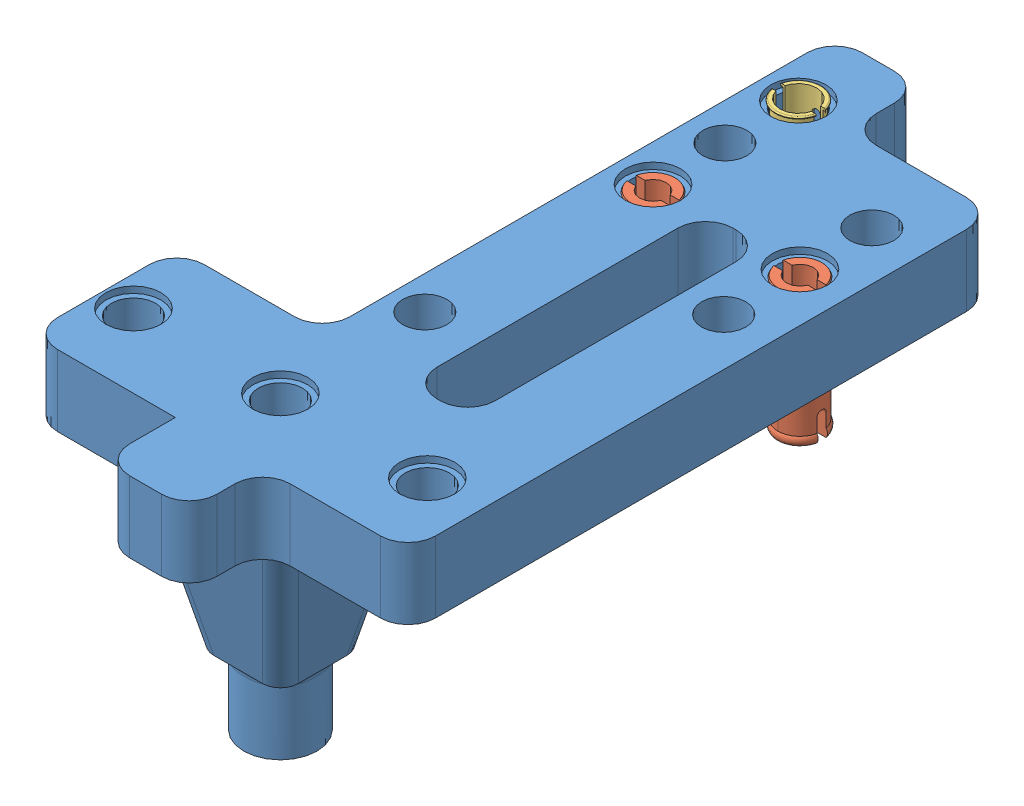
SolidWorks assembly Assem3.sldasm, configuration Default (file format 4400). Lengths in mm.
Overall size (41.18 31.96 79.8).
4 component instances, 3 part files, 6 mates.
Components (placement in the parent):
- Part Side frame Right-1: Part Side frame Right.SLDPRT [Default] at origin size (41.18 31.75 79.8)
- Pin Glashelder-1: Pin Glashelder.sldprt [Default] at (19.882 -0.7 -47.98) x (0 -1 0) z (0 0 1) size (14.4 5.84 5.84)
- Pin Glashelder-2: Pin Glashelder.sldprt [Default] at (35.882 -0.7 -47.98) x (0 -1 0) z (0 0 1) size (14.4 5.84 5.84)
- Open Pin Zwart-1: Open Pin Zwart.SLDPRT [Défaut] at (19.882 7.95 -66.31) x (0 -1 0) z (0 0 1) size (16.01 5.5 5.41)
Mates (geometry in assembly coordinates):
- Concentric1: concentric: cylinder of Part Side frame Right-1 through (19.882 0 -63.81) axis (0 1 0) radius 2.4; cylinder of Open Pin Zwart-1 through (19.882 8.5963 -63.81) axis (0 1 0) radius 2.25
- Concentric2: concentric: cylinder of Part Side frame Right-1 through (19.882 0 -47.98) axis (0 1 0) radius 2.4; cylinder of Pin Glashelder-1 through (19.882 7.2 -47.98) axis (0 -1 0) radius 2.3876
- Concentric3: concentric: cylinder of Part Side frame Right-1 through (35.882 0 -47.98) axis (0 1 0) radius 2.4; cylinder of Pin Glashelder-2 through (35.882 7.2 -47.98) axis (0 -1 0) radius 2.3876
- Coincident1: coincident anti-aligned: plane of Part Side frame Right-1 through (19.882 0.7 -47.98) normal (0 -1 0); plane of Pin Glashelder-1 through (19.882 0.7 -47.98) normal (0 1 0)
- Coincident2: coincident anti-aligned: plane of Part Side frame Right-1 through (35.882 0.7 -47.98) normal (0 -1 0); plane of Pin Glashelder-2 through (35.882 0.7 -47.98) normal (0 1 0)
- Coincident3: coincident anti-aligned: plane of Part Side frame Right-1 through (19.882 0.7 -63.81) normal (0 -1 0); circle of Open Pin Zwart-1
